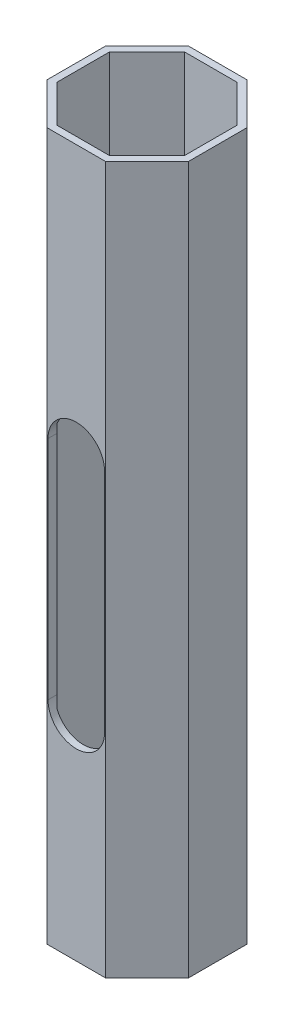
ISO-10303-21;
HEADER;
FILE_DESCRIPTION(('STEP AP214'),'2;1');
FILE_NAME('part.step','',(''),(''),'','','');
FILE_SCHEMA(('AUTOMOTIVE_DESIGN { 1 0 10303 214 1 1 1 1 }'));
ENDSEC;
DATA;
#1=APPLICATION_CONTEXT('core data for automotive mechanical design processes');
#2=APPLICATION_PROTOCOL_DEFINITION('international standard','automotive_design',2000,#1);
#3=PRODUCT_CONTEXT('',#1,'mechanical');
#4=PRODUCT('Part','Part','',(#3));
#5=PRODUCT_RELATED_PRODUCT_CATEGORY('part','',(#4));
#6=PRODUCT_DEFINITION_FORMATION('','',#4);
#7=PRODUCT_DEFINITION_CONTEXT('part definition',#1,'design');
#8=PRODUCT_DEFINITION('design','',#6,#7);
#9=PRODUCT_DEFINITION_SHAPE('','',#8);
#10=(LENGTH_UNIT() NAMED_UNIT(*) SI_UNIT(.MILLI.,.METRE.));
#11=(NAMED_UNIT(*) PLANE_ANGLE_UNIT() SI_UNIT($,.RADIAN.));
#12=(NAMED_UNIT(*) SI_UNIT($,.STERADIAN.) SOLID_ANGLE_UNIT());
#13=UNCERTAINTY_MEASURE_WITH_UNIT(LENGTH_MEASURE(1.E-05),#10,'distance_accuracy_value','');
#14=(GEOMETRIC_REPRESENTATION_CONTEXT(3) GLOBAL_UNCERTAINTY_ASSIGNED_CONTEXT((#13)) GLOBAL_UNIT_ASSIGNED_CONTEXT((#10,
#11,#12)) REPRESENTATION_CONTEXT('',''));
#15=CARTESIAN_POINT('',(0.,0.,0.));
#16=DIRECTION('',(0.,0.,1.));
#17=DIRECTION('',(1.,0.,0.));
#18=AXIS2_PLACEMENT_3D('',#15,#16,#17);
#19=CARTESIAN_POINT('',(-41.4213562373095,1000.,100.));
#20=DIRECTION('',(0.,0.,-1.));
#21=DIRECTION('',(-1.,0.,0.));
#22=AXIS2_PLACEMENT_3D('',#19,#20,#21);
#23=PLANE('',#22);
#24=DIRECTION('',(1.,0.,0.));
#25=VECTOR('',#24,1.);
#26=CARTESIAN_POINT('',(-41.4213562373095,0.,100.));
#27=LINE('',#26,#25);
#28=CARTESIAN_POINT('',(-41.4213562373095,0.,100.));
#29=VERTEX_POINT('',#28);
#30=CARTESIAN_POINT('',(41.4213562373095,0.,100.));
#31=VERTEX_POINT('',#30);
#32=EDGE_CURVE('E232',#29,#31,#27,.T.);
#33=ORIENTED_EDGE('',*,*,#32,.T.);
#34=DIRECTION('',(0.,-1.,0.));
#35=VECTOR('',#34,1.);
#36=CARTESIAN_POINT('',(41.4213562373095,1000.,100.));
#37=LINE('',#36,#35);
#38=CARTESIAN_POINT('',(41.4213562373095,1000.,100.));
#39=VERTEX_POINT('',#38);
#40=EDGE_CURVE('E11',#39,#31,#37,.T.);
#41=ORIENTED_EDGE('',*,*,#40,.F.);
#42=DIRECTION('',(1.,0.,0.));
#43=VECTOR('',#42,1.);
#44=CARTESIAN_POINT('',(-41.4213562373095,1000.,100.));
#45=LINE('',#44,#43);
#46=CARTESIAN_POINT('',(-41.4213562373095,1000.,100.));
#47=VERTEX_POINT('',#46);
#48=EDGE_CURVE('E289',#47,#39,#45,.T.);
#49=ORIENTED_EDGE('',*,*,#48,.F.);
#50=DIRECTION('',(0.,-1.,0.));
#51=VECTOR('',#50,1.);
#52=CARTESIAN_POINT('',(-41.4213562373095,1000.,100.));
#53=LINE('',#52,#51);
#54=EDGE_CURVE('E307',#47,#29,#53,.T.);
#55=ORIENTED_EDGE('',*,*,#54,.T.);
#56=EDGE_LOOP('',(#33,#41,#49,#55));
#57=FACE_BOUND('',#56,.T.);
#58=CARTESIAN_POINT('',(0.,300.,100.));
#59=DIRECTION('',(0.,0.,-1.));
#60=DIRECTION('',(-1.,0.,0.));
#61=AXIS2_PLACEMENT_3D('',#58,#59,#60);
#62=CIRCLE('',#61,40.);
#63=CARTESIAN_POINT('',(40.,300.,100.));
#64=VERTEX_POINT('',#63);
#65=CARTESIAN_POINT('',(-40.,300.,100.));
#66=VERTEX_POINT('',#65);
#67=EDGE_CURVE('E209',#64,#66,#62,.T.);
#68=ORIENTED_EDGE('',*,*,#67,.T.);
#69=DIRECTION('',(0.,1.,0.));
#70=VECTOR('',#69,1.);
#71=CARTESIAN_POINT('',(-40.,300.,100.));
#72=LINE('',#71,#70);
#73=CARTESIAN_POINT('',(-40.,620.,100.));
#74=VERTEX_POINT('',#73);
#75=EDGE_CURVE('E195',#66,#74,#72,.T.);
#76=ORIENTED_EDGE('',*,*,#75,.T.);
#77=CARTESIAN_POINT('',(0.,620.,100.));
#78=DIRECTION('',(0.,0.,-1.));
#79=DIRECTION('',(-1.,0.,0.));
#80=AXIS2_PLACEMENT_3D('',#77,#78,#79);
#81=CIRCLE('',#80,40.);
#82=CARTESIAN_POINT('',(40.,620.,100.));
#83=VERTEX_POINT('',#82);
#84=EDGE_CURVE('E186',#74,#83,#81,.T.);
#85=ORIENTED_EDGE('',*,*,#84,.T.);
#86=DIRECTION('',(0.,-1.,0.));
#87=VECTOR('',#86,1.);
#88=CARTESIAN_POINT('',(40.,300.,100.));
#89=LINE('',#88,#87);
#90=EDGE_CURVE('E206',#83,#64,#89,.T.);
#91=ORIENTED_EDGE('',*,*,#90,.T.);
#92=EDGE_LOOP('',(#68,#76,#85,#91));
#93=FACE_BOUND('',#92,.T.);
#94=ADVANCED_FACE('F33',(#57,#93),#23,.F.);
#95=CARTESIAN_POINT('',(-41.4213562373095,1000.,90.));
#96=DIRECTION('',(0.,0.,-1.));
#97=DIRECTION('',(-1.,0.,0.));
#98=AXIS2_PLACEMENT_3D('',#95,#96,#97);
#99=PLANE('',#98);
#100=DIRECTION('',(0.,-1.,0.));
#101=VECTOR('',#100,1.);
#102=CARTESIAN_POINT('',(-37.2792206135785,1000.,90.));
#103=LINE('',#102,#101);
#104=CARTESIAN_POINT('',(-37.2792206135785,285.499665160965,90.));
#105=VERTEX_POINT('',#104);
#106=CARTESIAN_POINT('',(-37.2792206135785,0.,90.));
#107=VERTEX_POINT('',#106);
#108=EDGE_CURVE('E236',#105,#107,#103,.T.);
#109=ORIENTED_EDGE('',*,*,#108,.F.);
#110=CARTESIAN_POINT('',(0.,300.,90.));
#111=DIRECTION('',(0.,0.,-1.));
#112=DIRECTION('',(-1.,0.,0.));
#113=AXIS2_PLACEMENT_3D('',#110,#111,#112);
#114=CIRCLE('',#113,40.);
#115=CARTESIAN_POINT('',(37.2792206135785,285.499665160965,90.));
#116=VERTEX_POINT('',#115);
#117=EDGE_CURVE('E217',#116,#105,#114,.T.);
#118=ORIENTED_EDGE('',*,*,#117,.F.);
#119=DIRECTION('',(0.,-1.,0.));
#120=VECTOR('',#119,1.);
#121=CARTESIAN_POINT('',(37.2792206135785,1000.,90.));
#122=LINE('',#121,#120);
#123=CARTESIAN_POINT('',(37.2792206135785,0.,90.));
#124=VERTEX_POINT('',#123);
#125=EDGE_CURVE('E233',#116,#124,#122,.T.);
#126=ORIENTED_EDGE('',*,*,#125,.T.);
#127=DIRECTION('',(1.,0.,0.));
#128=VECTOR('',#127,1.);
#129=CARTESIAN_POINT('',(-41.4213562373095,0.,90.));
#130=LINE('',#129,#128);
#131=EDGE_CURVE('E228',#107,#124,#130,.T.);
#132=ORIENTED_EDGE('',*,*,#131,.F.);
#133=EDGE_LOOP('',(#109,#118,#126,#132));
#134=FACE_BOUND('',#133,.T.);
#135=ADVANCED_FACE('F391',(#134),#99,.T.);
#136=CARTESIAN_POINT('',(37.2792206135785,1000.,90.));
#137=VERTEX_POINT('',#136);
#138=CARTESIAN_POINT('',(37.2792206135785,634.500334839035,90.));
#139=VERTEX_POINT('',#138);
#140=EDGE_CURVE('E229',#137,#139,#122,.T.);
#141=ORIENTED_EDGE('',*,*,#140,.T.);
#142=CARTESIAN_POINT('',(0.,620.,90.));
#143=DIRECTION('',(0.,0.,-1.));
#144=DIRECTION('',(-1.,0.,0.));
#145=AXIS2_PLACEMENT_3D('',#142,#143,#144);
#146=CIRCLE('',#145,40.);
#147=CARTESIAN_POINT('',(-37.2792206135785,634.500334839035,90.));
#148=VERTEX_POINT('',#147);
#149=EDGE_CURVE('E223',#148,#139,#146,.T.);
#150=ORIENTED_EDGE('',*,*,#149,.F.);
#151=CARTESIAN_POINT('',(-37.2792206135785,1000.,90.));
#152=VERTEX_POINT('',#151);
#153=EDGE_CURVE('E201',#152,#148,#103,.T.);
#154=ORIENTED_EDGE('',*,*,#153,.F.);
#155=DIRECTION('',(1.,0.,0.));
#156=VECTOR('',#155,1.);
#157=CARTESIAN_POINT('',(-41.4213562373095,1000.,90.));
#158=LINE('',#157,#156);
#159=EDGE_CURVE('E255',#152,#137,#158,.T.);
#160=ORIENTED_EDGE('',*,*,#159,.T.);
#161=EDGE_LOOP('',(#141,#150,#154,#160));
#162=FACE_BOUND('',#161,.T.);
#163=ADVANCED_FACE('F395',(#162),#99,.T.);
#164=CARTESIAN_POINT('',(34.350288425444,1000.,92.9289321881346));
#165=DIRECTION('',(-0.707106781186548,0.,-0.707106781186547));
#166=DIRECTION('',(-0.707106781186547,0.,0.707106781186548));
#167=AXIS2_PLACEMENT_3D('',#164,#165,#166);
#168=PLANE('',#167);
#169=ORIENTED_EDGE('',*,*,#125,.F.);
#170=CARTESIAN_POINT('',(0.,300.,127.279220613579));
#171=DIRECTION('',(-0.707106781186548,0.,-0.707106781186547));
#172=DIRECTION('',(0.707106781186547,0.,-0.707106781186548));
#173=AXIS2_PLACEMENT_3D('',#170,#171,#172);
#174=ELLIPSE('',#173,56.5685424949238,40.);
#175=CARTESIAN_POINT('',(40.,300.,87.2792206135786));
#176=VERTEX_POINT('',#175);
#177=EDGE_CURVE('E215',#176,#116,#174,.T.);
#178=ORIENTED_EDGE('',*,*,#177,.F.);
#179=DIRECTION('',(0.,-1.,0.));
#180=VECTOR('',#179,1.);
#181=CARTESIAN_POINT('',(40.,300.,87.2792206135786));
#182=LINE('',#181,#180);
#183=CARTESIAN_POINT('',(40.,620.,87.2792206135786));
#184=VERTEX_POINT('',#183);
#185=EDGE_CURVE('E212',#184,#176,#182,.T.);
#186=ORIENTED_EDGE('',*,*,#185,.F.);
#187=CARTESIAN_POINT('',(0.,620.,127.279220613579));
#188=DIRECTION('',(-0.707106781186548,0.,-0.707106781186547));
#189=DIRECTION('',(0.707106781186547,0.,-0.707106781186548));
#190=AXIS2_PLACEMENT_3D('',#187,#188,#189);
#191=ELLIPSE('',#190,56.5685424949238,40.);
#192=EDGE_CURVE('E225',#139,#184,#191,.T.);
#193=ORIENTED_EDGE('',*,*,#192,.F.);
#194=ORIENTED_EDGE('',*,*,#140,.F.);
#195=DIRECTION('',(0.707106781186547,0.,-0.707106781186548));
#196=VECTOR('',#195,1.);
#197=CARTESIAN_POINT('',(34.350288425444,1000.,92.9289321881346));
#198=LINE('',#197,#196);
#199=CARTESIAN_POINT('',(90.,1000.,37.2792206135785));
#200=VERTEX_POINT('',#199);
#201=EDGE_CURVE('E274',#137,#200,#198,.T.);
#202=ORIENTED_EDGE('',*,*,#201,.T.);
#203=DIRECTION('',(0.,-1.,0.));
#204=VECTOR('',#203,1.);
#205=CARTESIAN_POINT('',(90.,1000.,37.2792206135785));
#206=LINE('',#205,#204);
#207=CARTESIAN_POINT('',(90.,0.,37.2792206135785));
#208=VERTEX_POINT('',#207);
#209=EDGE_CURVE('E237',#200,#208,#206,.T.);
#210=ORIENTED_EDGE('',*,*,#209,.T.);
#211=DIRECTION('',(0.707106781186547,0.,-0.707106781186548));
#212=VECTOR('',#211,1.);
#213=CARTESIAN_POINT('',(34.350288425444,0.,92.9289321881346));
#214=LINE('',#213,#212);
#215=EDGE_CURVE('E251',#124,#208,#214,.T.);
#216=ORIENTED_EDGE('',*,*,#215,.F.);
#217=EDGE_LOOP('',(#169,#178,#186,#193,#194,#202,#210,#216));
#218=FACE_BOUND('',#217,.T.);
#219=ADVANCED_FACE('F401',(#218),#168,.T.);
#220=CARTESIAN_POINT('',(-92.9289321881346,1000.,34.350288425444));
#221=DIRECTION('',(0.707106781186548,0.,-0.707106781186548));
#222=DIRECTION('',(-0.707106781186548,0.,-0.707106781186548));
#223=AXIS2_PLACEMENT_3D('',#220,#221,#222);
#224=PLANE('',#223);
#225=DIRECTION('',(0.,1.,0.));
#226=VECTOR('',#225,1.);
#227=CARTESIAN_POINT('',(-40.,300.,87.2792206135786));
#228=LINE('',#227,#226);
#229=CARTESIAN_POINT('',(-40.,300.,87.2792206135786));
#230=VERTEX_POINT('',#229);
#231=CARTESIAN_POINT('',(-40.,620.,87.2792206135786));
#232=VERTEX_POINT('',#231);
#233=EDGE_CURVE('E192',#230,#232,#228,.T.);
#234=ORIENTED_EDGE('',*,*,#233,.F.);
#235=CARTESIAN_POINT('',(0.,300.,127.279220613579));
#236=DIRECTION('',(0.707106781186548,0.,-0.707106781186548));
#237=DIRECTION('',(-0.707106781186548,0.,-0.707106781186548));
#238=AXIS2_PLACEMENT_3D('',#235,#236,#237);
#239=ELLIPSE('',#238,56.5685424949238,40.);
#240=EDGE_CURVE('E55',#105,#230,#239,.T.);
#241=ORIENTED_EDGE('',*,*,#240,.F.);
#242=ORIENTED_EDGE('',*,*,#108,.T.);
#243=DIRECTION('',(0.707106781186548,0.,0.707106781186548));
#244=VECTOR('',#243,1.);
#245=CARTESIAN_POINT('',(-92.9289321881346,0.,34.350288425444));
#246=LINE('',#245,#244);
#247=CARTESIAN_POINT('',(-90.,0.,37.2792206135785));
#248=VERTEX_POINT('',#247);
#249=EDGE_CURVE('E252',#248,#107,#246,.T.);
#250=ORIENTED_EDGE('',*,*,#249,.F.);
#251=DIRECTION('',(0.,-1.,0.));
#252=VECTOR('',#251,1.);
#253=CARTESIAN_POINT('',(-90.,1000.,37.2792206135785));
#254=LINE('',#253,#252);
#255=CARTESIAN_POINT('',(-90.,1000.,37.2792206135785));
#256=VERTEX_POINT('',#255);
#257=EDGE_CURVE('E235',#256,#248,#254,.T.);
#258=ORIENTED_EDGE('',*,*,#257,.F.);
#259=DIRECTION('',(0.707106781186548,0.,0.707106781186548));
#260=VECTOR('',#259,1.);
#261=CARTESIAN_POINT('',(-92.9289321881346,1000.,34.350288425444));
#262=LINE('',#261,#260);
#263=EDGE_CURVE('E287',#256,#152,#262,.T.);
#264=ORIENTED_EDGE('',*,*,#263,.T.);
#265=ORIENTED_EDGE('',*,*,#153,.T.);
#266=CARTESIAN_POINT('',(0.,620.,127.279220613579));
#267=DIRECTION('',(0.707106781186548,0.,-0.707106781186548));
#268=DIRECTION('',(-0.707106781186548,0.,-0.707106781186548));
#269=AXIS2_PLACEMENT_3D('',#266,#267,#268);
#270=ELLIPSE('',#269,56.5685424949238,40.);
#271=EDGE_CURVE('E182',#232,#148,#270,.T.);
#272=ORIENTED_EDGE('',*,*,#271,.F.);
#273=EDGE_LOOP('',(#234,#241,#242,#250,#258,#264,#265,#272));
#274=FACE_BOUND('',#273,.T.);
#275=ADVANCED_FACE('F199',(#274),#224,.T.);
#276=CARTESIAN_POINT('',(41.4213562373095,1000.,100.));
#277=DIRECTION('',(-0.707106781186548,0.,-0.707106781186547));
#278=DIRECTION('',(-0.707106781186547,0.,0.707106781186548));
#279=AXIS2_PLACEMENT_3D('',#276,#277,#278);
#280=PLANE('',#279);
#281=DIRECTION('',(0.707106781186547,0.,-0.707106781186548));
#282=VECTOR('',#281,1.);
#283=CARTESIAN_POINT('',(41.4213562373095,0.,100.));
#284=LINE('',#283,#282);
#285=CARTESIAN_POINT('',(100.,0.,41.4213562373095));
#286=VERTEX_POINT('',#285);
#287=EDGE_CURVE('E310',#31,#286,#284,.T.);
#288=ORIENTED_EDGE('',*,*,#287,.T.);
#289=DIRECTION('',(0.,-1.,0.));
#290=VECTOR('',#289,1.);
#291=CARTESIAN_POINT('',(100.,1000.,41.4213562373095));
#292=LINE('',#291,#290);
#293=CARTESIAN_POINT('',(100.,1000.,41.4213562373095));
#294=VERTEX_POINT('',#293);
#295=EDGE_CURVE('E40',#294,#286,#292,.T.);
#296=ORIENTED_EDGE('',*,*,#295,.F.);
#297=DIRECTION('',(0.707106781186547,0.,-0.707106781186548));
#298=VECTOR('',#297,1.);
#299=CARTESIAN_POINT('',(41.4213562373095,1000.,100.));
#300=LINE('',#299,#298);
#301=EDGE_CURVE('E292',#39,#294,#300,.T.);
#302=ORIENTED_EDGE('',*,*,#301,.F.);
#303=ORIENTED_EDGE('',*,*,#40,.T.);
#304=EDGE_LOOP('',(#288,#296,#302,#303));
#305=FACE_BOUND('',#304,.T.);
#306=ADVANCED_FACE('F367',(#305),#280,.F.);
#307=CARTESIAN_POINT('',(100.,1000.,41.4213562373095));
#308=DIRECTION('',(-1.,0.,0.));
#309=DIRECTION('',(0.,0.,1.));
#310=AXIS2_PLACEMENT_3D('',#307,#308,#309);
#311=PLANE('',#310);
#312=DIRECTION('',(0.,0.,-1.));
#313=VECTOR('',#312,1.);
#314=CARTESIAN_POINT('',(100.,0.,41.4213562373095));
#315=LINE('',#314,#313);
#316=CARTESIAN_POINT('',(100.,0.,-41.4213562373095));
#317=VERTEX_POINT('',#316);
#318=EDGE_CURVE('E312',#286,#317,#315,.T.);
#319=ORIENTED_EDGE('',*,*,#318,.T.);
#320=DIRECTION('',(0.,-1.,0.));
#321=VECTOR('',#320,1.);
#322=CARTESIAN_POINT('',(100.,1000.,-41.4213562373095));
#323=LINE('',#322,#321);
#324=CARTESIAN_POINT('',(100.,1000.,-41.4213562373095));
#325=VERTEX_POINT('',#324);
#326=EDGE_CURVE('E337',#325,#317,#323,.T.);
#327=ORIENTED_EDGE('',*,*,#326,.F.);
#328=DIRECTION('',(0.,0.,-1.));
#329=VECTOR('',#328,1.);
#330=CARTESIAN_POINT('',(100.,1000.,41.4213562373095));
#331=LINE('',#330,#329);
#332=EDGE_CURVE('E295',#294,#325,#331,.T.);
#333=ORIENTED_EDGE('',*,*,#332,.F.);
#334=ORIENTED_EDGE('',*,*,#295,.T.);
#335=EDGE_LOOP('',(#319,#327,#333,#334));
#336=FACE_BOUND('',#335,.T.);
#337=ADVANCED_FACE('F344',(#336),#311,.F.);
#338=CARTESIAN_POINT('',(100.,1000.,-41.4213562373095));
#339=DIRECTION('',(-0.707106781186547,0.,0.707106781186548));
#340=DIRECTION('',(0.707106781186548,0.,0.707106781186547));
#341=AXIS2_PLACEMENT_3D('',#338,#339,#340);
#342=PLANE('',#341);
#343=DIRECTION('',(-0.707106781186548,0.,-0.707106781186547));
#344=VECTOR('',#343,1.);
#345=CARTESIAN_POINT('',(100.,0.,-41.4213562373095));
#346=LINE('',#345,#344);
#347=CARTESIAN_POINT('',(41.4213562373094,0.,-100.));
#348=VERTEX_POINT('',#347);
#349=EDGE_CURVE('E314',#317,#348,#346,.T.);
#350=ORIENTED_EDGE('',*,*,#349,.T.);
#351=DIRECTION('',(0.,-1.,0.));
#352=VECTOR('',#351,1.);
#353=CARTESIAN_POINT('',(41.4213562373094,1000.,-100.));
#354=LINE('',#353,#352);
#355=CARTESIAN_POINT('',(41.4213562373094,1000.,-100.));
#356=VERTEX_POINT('',#355);
#357=EDGE_CURVE('E334',#356,#348,#354,.T.);
#358=ORIENTED_EDGE('',*,*,#357,.F.);
#359=DIRECTION('',(-0.707106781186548,0.,-0.707106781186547));
#360=VECTOR('',#359,1.);
#361=CARTESIAN_POINT('',(100.,1000.,-41.4213562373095));
#362=LINE('',#361,#360);
#363=EDGE_CURVE('E297',#325,#356,#362,.T.);
#364=ORIENTED_EDGE('',*,*,#363,.F.);
#365=ORIENTED_EDGE('',*,*,#326,.T.);
#366=EDGE_LOOP('',(#350,#358,#364,#365));
#367=FACE_BOUND('',#366,.T.);
#368=ADVANCED_FACE('F355',(#367),#342,.F.);
#369=CARTESIAN_POINT('',(41.4213562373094,1000.,-100.));
#370=DIRECTION('',(0.,0.,1.));
#371=DIRECTION('',(1.,0.,0.));
#372=AXIS2_PLACEMENT_3D('',#369,#370,#371);
#373=PLANE('',#372);
#374=DIRECTION('',(-1.,0.,0.));
#375=VECTOR('',#374,1.);
#376=CARTESIAN_POINT('',(41.4213562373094,0.,-100.));
#377=LINE('',#376,#375);
#378=CARTESIAN_POINT('',(-41.4213562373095,0.,-100.));
#379=VERTEX_POINT('',#378);
#380=EDGE_CURVE('E316',#348,#379,#377,.T.);
#381=ORIENTED_EDGE('',*,*,#380,.T.);
#382=DIRECTION('',(0.,-1.,0.));
#383=VECTOR('',#382,1.);
#384=CARTESIAN_POINT('',(-41.4213562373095,1000.,-100.));
#385=LINE('',#384,#383);
#386=CARTESIAN_POINT('',(-41.4213562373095,1000.,-100.));
#387=VERTEX_POINT('',#386);
#388=EDGE_CURVE('E331',#387,#379,#385,.T.);
#389=ORIENTED_EDGE('',*,*,#388,.F.);
#390=DIRECTION('',(-1.,0.,0.));
#391=VECTOR('',#390,1.);
#392=CARTESIAN_POINT('',(41.4213562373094,1000.,-100.));
#393=LINE('',#392,#391);
#394=EDGE_CURVE('E299',#356,#387,#393,.T.);
#395=ORIENTED_EDGE('',*,*,#394,.F.);
#396=ORIENTED_EDGE('',*,*,#357,.T.);
#397=EDGE_LOOP('',(#381,#389,#395,#396));
#398=FACE_BOUND('',#397,.T.);
#399=ADVANCED_FACE('F359',(#398),#373,.F.);
#400=CARTESIAN_POINT('',(-41.4213562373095,1000.,-100.));
#401=DIRECTION('',(0.707106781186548,0.,0.707106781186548));
#402=DIRECTION('',(0.707106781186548,0.,-0.707106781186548));
#403=AXIS2_PLACEMENT_3D('',#400,#401,#402);
#404=PLANE('',#403);
#405=DIRECTION('',(-0.707106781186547,0.,0.707106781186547));
#406=VECTOR('',#405,1.);
#407=CARTESIAN_POINT('',(-41.4213562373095,0.,-100.));
#408=LINE('',#407,#406);
#409=CARTESIAN_POINT('',(-100.,0.,-41.4213562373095));
#410=VERTEX_POINT('',#409);
#411=EDGE_CURVE('E318',#379,#410,#408,.T.);
#412=ORIENTED_EDGE('',*,*,#411,.T.);
#413=DIRECTION('',(0.,-1.,0.));
#414=VECTOR('',#413,1.);
#415=CARTESIAN_POINT('',(-100.,1000.,-41.4213562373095));
#416=LINE('',#415,#414);
#417=CARTESIAN_POINT('',(-100.,1000.,-41.4213562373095));
#418=VERTEX_POINT('',#417);
#419=EDGE_CURVE('E328',#418,#410,#416,.T.);
#420=ORIENTED_EDGE('',*,*,#419,.F.);
#421=DIRECTION('',(-0.707106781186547,0.,0.707106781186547));
#422=VECTOR('',#421,1.);
#423=CARTESIAN_POINT('',(-41.4213562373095,1000.,-100.));
#424=LINE('',#423,#422);
#425=EDGE_CURVE('E301',#387,#418,#424,.T.);
#426=ORIENTED_EDGE('',*,*,#425,.F.);
#427=ORIENTED_EDGE('',*,*,#388,.T.);
#428=EDGE_LOOP('',(#412,#420,#426,#427));
#429=FACE_BOUND('',#428,.T.);
#430=ADVANCED_FACE('F381',(#429),#404,.F.);
#431=CARTESIAN_POINT('',(-100.,1000.,-41.4213562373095));
#432=DIRECTION('',(1.,0.,0.));
#433=DIRECTION('',(0.,0.,-1.));
#434=AXIS2_PLACEMENT_3D('',#431,#432,#433);
#435=PLANE('',#434);
#436=DIRECTION('',(0.,0.,1.));
#437=VECTOR('',#436,1.);
#438=CARTESIAN_POINT('',(-100.,0.,-41.4213562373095));
#439=LINE('',#438,#437);
#440=CARTESIAN_POINT('',(-100.,0.,41.4213562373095));
#441=VERTEX_POINT('',#440);
#442=EDGE_CURVE('E320',#410,#441,#439,.T.);
#443=ORIENTED_EDGE('',*,*,#442,.T.);
#444=DIRECTION('',(0.,-1.,0.));
#445=VECTOR('',#444,1.);
#446=CARTESIAN_POINT('',(-100.,1000.,41.4213562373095));
#447=LINE('',#446,#445);
#448=CARTESIAN_POINT('',(-100.,1000.,41.4213562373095));
#449=VERTEX_POINT('',#448);
#450=EDGE_CURVE('E325',#449,#441,#447,.T.);
#451=ORIENTED_EDGE('',*,*,#450,.F.);
#452=DIRECTION('',(0.,0.,1.));
#453=VECTOR('',#452,1.);
#454=CARTESIAN_POINT('',(-100.,1000.,-41.4213562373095));
#455=LINE('',#454,#453);
#456=EDGE_CURVE('E303',#418,#449,#455,.T.);
#457=ORIENTED_EDGE('',*,*,#456,.F.);
#458=ORIENTED_EDGE('',*,*,#419,.T.);
#459=EDGE_LOOP('',(#443,#451,#457,#458));
#460=FACE_BOUND('',#459,.T.);
#461=ADVANCED_FACE('F379',(#460),#435,.F.);
#462=CARTESIAN_POINT('',(-100.,1000.,41.4213562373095));
#463=DIRECTION('',(0.707106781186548,0.,-0.707106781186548));
#464=DIRECTION('',(-0.707106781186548,0.,-0.707106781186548));
#465=AXIS2_PLACEMENT_3D('',#462,#463,#464);
#466=PLANE('',#465);
#467=DIRECTION('',(0.707106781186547,0.,0.707106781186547));
#468=VECTOR('',#467,1.);
#469=CARTESIAN_POINT('',(-100.,0.,41.4213562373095));
#470=LINE('',#469,#468);
#471=EDGE_CURVE('E293',#441,#29,#470,.T.);
#472=ORIENTED_EDGE('',*,*,#471,.T.);
#473=ORIENTED_EDGE('',*,*,#54,.F.);
#474=DIRECTION('',(0.707106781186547,0.,0.707106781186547));
#475=VECTOR('',#474,1.);
#476=CARTESIAN_POINT('',(-100.,1000.,41.4213562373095));
#477=LINE('',#476,#475);
#478=EDGE_CURVE('E305',#449,#47,#477,.T.);
#479=ORIENTED_EDGE('',*,*,#478,.F.);
#480=ORIENTED_EDGE('',*,*,#450,.T.);
#481=EDGE_LOOP('',(#472,#473,#479,#480));
#482=FACE_BOUND('',#481,.T.);
#483=ADVANCED_FACE('F374',(#482),#466,.F.);
#484=CARTESIAN_POINT('',(0.,1000.,0.));
#485=DIRECTION('',(0.,1.,0.));
#486=DIRECTION('',(0.,0.,1.));
#487=AXIS2_PLACEMENT_3D('',#484,#485,#486);
#488=PLANE('',#487);
#489=ORIENTED_EDGE('',*,*,#159,.F.);
#490=ORIENTED_EDGE('',*,*,#263,.F.);
#491=DIRECTION('',(0.,0.,1.));
#492=VECTOR('',#491,1.);
#493=CARTESIAN_POINT('',(-90.0000000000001,1000.,-41.4213562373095));
#494=LINE('',#493,#492);
#495=CARTESIAN_POINT('',(-90.0000000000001,1000.,-37.2792206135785));
#496=VERTEX_POINT('',#495);
#497=EDGE_CURVE('E284',#496,#256,#494,.T.);
#498=ORIENTED_EDGE('',*,*,#497,.F.);
#499=DIRECTION('',(-0.707106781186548,0.,0.707106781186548));
#500=VECTOR('',#499,1.);
#501=CARTESIAN_POINT('',(-34.350288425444,1000.,-92.9289321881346));
#502=LINE('',#501,#500);
#503=CARTESIAN_POINT('',(-37.2792206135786,1000.,-90.));
#504=VERTEX_POINT('',#503);
#505=EDGE_CURVE('E282',#504,#496,#502,.T.);
#506=ORIENTED_EDGE('',*,*,#505,.F.);
#507=DIRECTION('',(-1.,0.,0.));
#508=VECTOR('',#507,1.);
#509=CARTESIAN_POINT('',(41.4213562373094,1000.,-90.0000000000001));
#510=LINE('',#509,#508);
#511=CARTESIAN_POINT('',(37.2792206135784,1000.,-90.0000000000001));
#512=VERTEX_POINT('',#511);
#513=EDGE_CURVE('E280',#512,#504,#510,.T.);
#514=ORIENTED_EDGE('',*,*,#513,.F.);
#515=DIRECTION('',(-0.707106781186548,0.,-0.707106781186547));
#516=VECTOR('',#515,1.);
#517=CARTESIAN_POINT('',(92.9289321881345,1000.,-34.350288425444));
#518=LINE('',#517,#516);
#519=CARTESIAN_POINT('',(90.,1000.,-37.2792206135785));
#520=VERTEX_POINT('',#519);
#521=EDGE_CURVE('E278',#520,#512,#518,.T.);
#522=ORIENTED_EDGE('',*,*,#521,.F.);
#523=DIRECTION('',(0.,0.,-1.));
#524=VECTOR('',#523,1.);
#525=CARTESIAN_POINT('',(90.,1000.,41.4213562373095));
#526=LINE('',#525,#524);
#527=EDGE_CURVE('E276',#200,#520,#526,.T.);
#528=ORIENTED_EDGE('',*,*,#527,.F.);
#529=ORIENTED_EDGE('',*,*,#201,.F.);
#530=EDGE_LOOP('',(#489,#490,#498,#506,#514,#522,#528,#529));
#531=FACE_BOUND('',#530,.T.);
#532=ORIENTED_EDGE('',*,*,#48,.T.);
#533=ORIENTED_EDGE('',*,*,#301,.T.);
#534=ORIENTED_EDGE('',*,*,#332,.T.);
#535=ORIENTED_EDGE('',*,*,#363,.T.);
#536=ORIENTED_EDGE('',*,*,#394,.T.);
#537=ORIENTED_EDGE('',*,*,#425,.T.);
#538=ORIENTED_EDGE('',*,*,#456,.T.);
#539=ORIENTED_EDGE('',*,*,#478,.T.);
#540=EDGE_LOOP('',(#532,#533,#534,#535,#536,#537,#538,#539));
#541=FACE_BOUND('',#540,.T.);
#542=ADVANCED_FACE('F363',(#531,#541),#488,.T.);
#543=CARTESIAN_POINT('',(0.,0.,0.));
#544=DIRECTION('',(0.,1.,0.));
#545=DIRECTION('',(0.,0.,1.));
#546=AXIS2_PLACEMENT_3D('',#543,#544,#545);
#547=PLANE('',#546);
#548=ORIENTED_EDGE('',*,*,#249,.T.);
#549=ORIENTED_EDGE('',*,*,#131,.T.);
#550=ORIENTED_EDGE('',*,*,#215,.T.);
#551=DIRECTION('',(0.,0.,-1.));
#552=VECTOR('',#551,1.);
#553=CARTESIAN_POINT('',(90.,0.,41.4213562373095));
#554=LINE('',#553,#552);
#555=CARTESIAN_POINT('',(90.,0.,-37.2792206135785));
#556=VERTEX_POINT('',#555);
#557=EDGE_CURVE('E268',#208,#556,#554,.T.);
#558=ORIENTED_EDGE('',*,*,#557,.T.);
#559=DIRECTION('',(-0.707106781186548,0.,-0.707106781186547));
#560=VECTOR('',#559,1.);
#561=CARTESIAN_POINT('',(92.9289321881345,0.,-34.350288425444));
#562=LINE('',#561,#560);
#563=CARTESIAN_POINT('',(37.2792206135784,0.,-90.0000000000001));
#564=VERTEX_POINT('',#563);
#565=EDGE_CURVE('E265',#556,#564,#562,.T.);
#566=ORIENTED_EDGE('',*,*,#565,.T.);
#567=DIRECTION('',(-1.,0.,0.));
#568=VECTOR('',#567,1.);
#569=CARTESIAN_POINT('',(41.4213562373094,0.,-90.0000000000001));
#570=LINE('',#569,#568);
#571=CARTESIAN_POINT('',(-37.2792206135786,0.,-90.));
#572=VERTEX_POINT('',#571);
#573=EDGE_CURVE('E262',#564,#572,#570,.T.);
#574=ORIENTED_EDGE('',*,*,#573,.T.);
#575=DIRECTION('',(-0.707106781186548,0.,0.707106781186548));
#576=VECTOR('',#575,1.);
#577=CARTESIAN_POINT('',(-34.350288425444,0.,-92.9289321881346));
#578=LINE('',#577,#576);
#579=CARTESIAN_POINT('',(-90.0000000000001,0.,-37.2792206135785));
#580=VERTEX_POINT('',#579);
#581=EDGE_CURVE('E259',#572,#580,#578,.T.);
#582=ORIENTED_EDGE('',*,*,#581,.T.);
#583=DIRECTION('',(0.,0.,1.));
#584=VECTOR('',#583,1.);
#585=CARTESIAN_POINT('',(-90.0000000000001,0.,-41.4213562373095));
#586=LINE('',#585,#584);
#587=EDGE_CURVE('E256',#580,#248,#586,.T.);
#588=ORIENTED_EDGE('',*,*,#587,.T.);
#589=EDGE_LOOP('',(#548,#549,#550,#558,#566,#574,#582,#588));
#590=FACE_BOUND('',#589,.T.);
#591=ORIENTED_EDGE('',*,*,#32,.F.);
#592=ORIENTED_EDGE('',*,*,#471,.F.);
#593=ORIENTED_EDGE('',*,*,#442,.F.);
#594=ORIENTED_EDGE('',*,*,#411,.F.);
#595=ORIENTED_EDGE('',*,*,#380,.F.);
#596=ORIENTED_EDGE('',*,*,#349,.F.);
#597=ORIENTED_EDGE('',*,*,#318,.F.);
#598=ORIENTED_EDGE('',*,*,#287,.F.);
#599=EDGE_LOOP('',(#591,#592,#593,#594,#595,#596,#597,#598));
#600=FACE_BOUND('',#599,.T.);
#601=ADVANCED_FACE('F350',(#590,#600),#547,.F.);
#602=CARTESIAN_POINT('',(90.,1000.,41.4213562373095));
#603=DIRECTION('',(-1.,0.,0.));
#604=DIRECTION('',(0.,0.,1.));
#605=AXIS2_PLACEMENT_3D('',#602,#603,#604);
#606=PLANE('',#605);
#607=ORIENTED_EDGE('',*,*,#557,.F.);
#608=ORIENTED_EDGE('',*,*,#209,.F.);
#609=ORIENTED_EDGE('',*,*,#527,.T.);
#610=DIRECTION('',(0.,-1.,0.));
#611=VECTOR('',#610,1.);
#612=CARTESIAN_POINT('',(90.,1000.,-37.2792206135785));
#613=LINE('',#612,#611);
#614=EDGE_CURVE('E240',#520,#556,#613,.T.);
#615=ORIENTED_EDGE('',*,*,#614,.T.);
#616=EDGE_LOOP('',(#607,#608,#609,#615));
#617=FACE_BOUND('',#616,.T.);
#618=ADVANCED_FACE('F411',(#617),#606,.T.);
#619=CARTESIAN_POINT('',(92.9289321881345,1000.,-34.350288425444));
#620=DIRECTION('',(-0.707106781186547,0.,0.707106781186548));
#621=DIRECTION('',(0.707106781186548,0.,0.707106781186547));
#622=AXIS2_PLACEMENT_3D('',#619,#620,#621);
#623=PLANE('',#622);
#624=ORIENTED_EDGE('',*,*,#565,.F.);
#625=ORIENTED_EDGE('',*,*,#614,.F.);
#626=ORIENTED_EDGE('',*,*,#521,.T.);
#627=DIRECTION('',(0.,-1.,0.));
#628=VECTOR('',#627,1.);
#629=CARTESIAN_POINT('',(37.2792206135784,1000.,-90.0000000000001));
#630=LINE('',#629,#628);
#631=EDGE_CURVE('E242',#512,#564,#630,.T.);
#632=ORIENTED_EDGE('',*,*,#631,.T.);
#633=EDGE_LOOP('',(#624,#625,#626,#632));
#634=FACE_BOUND('',#633,.T.);
#635=ADVANCED_FACE('F414',(#634),#623,.T.);
#636=CARTESIAN_POINT('',(41.4213562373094,1000.,-90.0000000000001));
#637=DIRECTION('',(0.,0.,1.));
#638=DIRECTION('',(1.,0.,0.));
#639=AXIS2_PLACEMENT_3D('',#636,#637,#638);
#640=PLANE('',#639);
#641=ORIENTED_EDGE('',*,*,#573,.F.);
#642=ORIENTED_EDGE('',*,*,#631,.F.);
#643=ORIENTED_EDGE('',*,*,#513,.T.);
#644=DIRECTION('',(0.,-1.,0.));
#645=VECTOR('',#644,1.);
#646=CARTESIAN_POINT('',(-37.2792206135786,1000.,-90.));
#647=LINE('',#646,#645);
#648=EDGE_CURVE('E244',#504,#572,#647,.T.);
#649=ORIENTED_EDGE('',*,*,#648,.T.);
#650=EDGE_LOOP('',(#641,#642,#643,#649));
#651=FACE_BOUND('',#650,.T.);
#652=ADVANCED_FACE('F418',(#651),#640,.T.);
#653=CARTESIAN_POINT('',(-34.350288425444,1000.,-92.9289321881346));
#654=DIRECTION('',(0.707106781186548,0.,0.707106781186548));
#655=DIRECTION('',(0.707106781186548,0.,-0.707106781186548));
#656=AXIS2_PLACEMENT_3D('',#653,#654,#655);
#657=PLANE('',#656);
#658=ORIENTED_EDGE('',*,*,#581,.F.);
#659=ORIENTED_EDGE('',*,*,#648,.F.);
#660=ORIENTED_EDGE('',*,*,#505,.T.);
#661=DIRECTION('',(0.,-1.,0.));
#662=VECTOR('',#661,1.);
#663=CARTESIAN_POINT('',(-90.0000000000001,1000.,-37.2792206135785));
#664=LINE('',#663,#662);
#665=EDGE_CURVE('E246',#496,#580,#664,.T.);
#666=ORIENTED_EDGE('',*,*,#665,.T.);
#667=EDGE_LOOP('',(#658,#659,#660,#666));
#668=FACE_BOUND('',#667,.T.);
#669=ADVANCED_FACE('F422',(#668),#657,.T.);
#670=CARTESIAN_POINT('',(-90.0000000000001,1000.,-41.4213562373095));
#671=DIRECTION('',(1.,0.,0.));
#672=DIRECTION('',(0.,0.,-1.));
#673=AXIS2_PLACEMENT_3D('',#670,#671,#672);
#674=PLANE('',#673);
#675=ORIENTED_EDGE('',*,*,#587,.F.);
#676=ORIENTED_EDGE('',*,*,#665,.F.);
#677=ORIENTED_EDGE('',*,*,#497,.T.);
#678=ORIENTED_EDGE('',*,*,#257,.T.);
#679=EDGE_LOOP('',(#675,#676,#677,#678));
#680=FACE_BOUND('',#679,.T.);
#681=ADVANCED_FACE('F426',(#680),#674,.T.);
#682=CARTESIAN_POINT('',(0.,300.,100.001));
#683=DIRECTION('',(0.,0.,-1.));
#684=DIRECTION('',(-1.,0.,0.));
#685=AXIS2_PLACEMENT_3D('',#682,#683,#684);
#686=CYLINDRICAL_SURFACE('',#685,40.);
#687=DIRECTION('',(0.,0.,-1.));
#688=VECTOR('',#687,1.);
#689=CARTESIAN_POINT('',(40.,300.,100.001));
#690=LINE('',#689,#688);
#691=EDGE_CURVE('E196',#64,#176,#690,.T.);
#692=ORIENTED_EDGE('',*,*,#691,.T.);
#693=ORIENTED_EDGE('',*,*,#177,.T.);
#694=ORIENTED_EDGE('',*,*,#117,.T.);
#695=ORIENTED_EDGE('',*,*,#240,.T.);
#696=DIRECTION('',(0.,0.,-1.));
#697=VECTOR('',#696,1.);
#698=CARTESIAN_POINT('',(-40.,300.,100.001));
#699=LINE('',#698,#697);
#700=EDGE_CURVE('E189',#66,#230,#699,.T.);
#701=ORIENTED_EDGE('',*,*,#700,.F.);
#702=ORIENTED_EDGE('',*,*,#67,.F.);
#703=EDGE_LOOP('',(#692,#693,#694,#695,#701,#702));
#704=FACE_BOUND('',#703,.T.);
#705=ADVANCED_FACE('F406',(#704),#686,.F.);
#706=CARTESIAN_POINT('',(40.,300.,100.001));
#707=DIRECTION('',(-1.,0.,0.));
#708=DIRECTION('',(0.,0.,1.));
#709=AXIS2_PLACEMENT_3D('',#706,#707,#708);
#710=PLANE('',#709);
#711=DIRECTION('',(0.,0.,-1.));
#712=VECTOR('',#711,1.);
#713=CARTESIAN_POINT('',(40.,620.,100.001));
#714=LINE('',#713,#712);
#715=EDGE_CURVE('E188',#83,#184,#714,.T.);
#716=ORIENTED_EDGE('',*,*,#715,.T.);
#717=ORIENTED_EDGE('',*,*,#185,.T.);
#718=ORIENTED_EDGE('',*,*,#691,.F.);
#719=ORIENTED_EDGE('',*,*,#90,.F.);
#720=EDGE_LOOP('',(#716,#717,#718,#719));
#721=FACE_BOUND('',#720,.T.);
#722=ADVANCED_FACE('F478',(#721),#710,.T.);
#723=CARTESIAN_POINT('',(0.,620.,100.001));
#724=DIRECTION('',(0.,0.,-1.));
#725=DIRECTION('',(-1.,0.,0.));
#726=AXIS2_PLACEMENT_3D('',#723,#724,#725);
#727=CYLINDRICAL_SURFACE('',#726,40.);
#728=DIRECTION('',(0.,0.,-1.));
#729=VECTOR('',#728,1.);
#730=CARTESIAN_POINT('',(-40.,620.,100.001));
#731=LINE('',#730,#729);
#732=EDGE_CURVE('E47',#74,#232,#731,.T.);
#733=ORIENTED_EDGE('',*,*,#732,.T.);
#734=ORIENTED_EDGE('',*,*,#271,.T.);
#735=ORIENTED_EDGE('',*,*,#149,.T.);
#736=ORIENTED_EDGE('',*,*,#192,.T.);
#737=ORIENTED_EDGE('',*,*,#715,.F.);
#738=ORIENTED_EDGE('',*,*,#84,.F.);
#739=EDGE_LOOP('',(#733,#734,#735,#736,#737,#738));
#740=FACE_BOUND('',#739,.T.);
#741=ADVANCED_FACE('F180',(#740),#727,.F.);
#742=CARTESIAN_POINT('',(-40.,300.,100.001));
#743=DIRECTION('',(1.,0.,0.));
#744=DIRECTION('',(0.,0.,-1.));
#745=AXIS2_PLACEMENT_3D('',#742,#743,#744);
#746=PLANE('',#745);
#747=ORIENTED_EDGE('',*,*,#700,.T.);
#748=ORIENTED_EDGE('',*,*,#233,.T.);
#749=ORIENTED_EDGE('',*,*,#732,.F.);
#750=ORIENTED_EDGE('',*,*,#75,.F.);
#751=EDGE_LOOP('',(#747,#748,#749,#750));
#752=FACE_BOUND('',#751,.T.);
#753=ADVANCED_FACE('F193',(#752),#746,.T.);
#754=CLOSED_SHELL('',(#94,#135,#163,#219,#275,#306,#337,#368,#399,#430,#461,#483,#542,#601,#618,
#635,#652,#669,#681,#705,#722,#741,#753));
#755=MANIFOLD_SOLID_BREP('B2',#754);
#756=ADVANCED_BREP_SHAPE_REPRESENTATION('',(#18,#755),#14);
#757=SHAPE_DEFINITION_REPRESENTATION(#9,#756);
ENDSEC;
END-ISO-10303-21;
